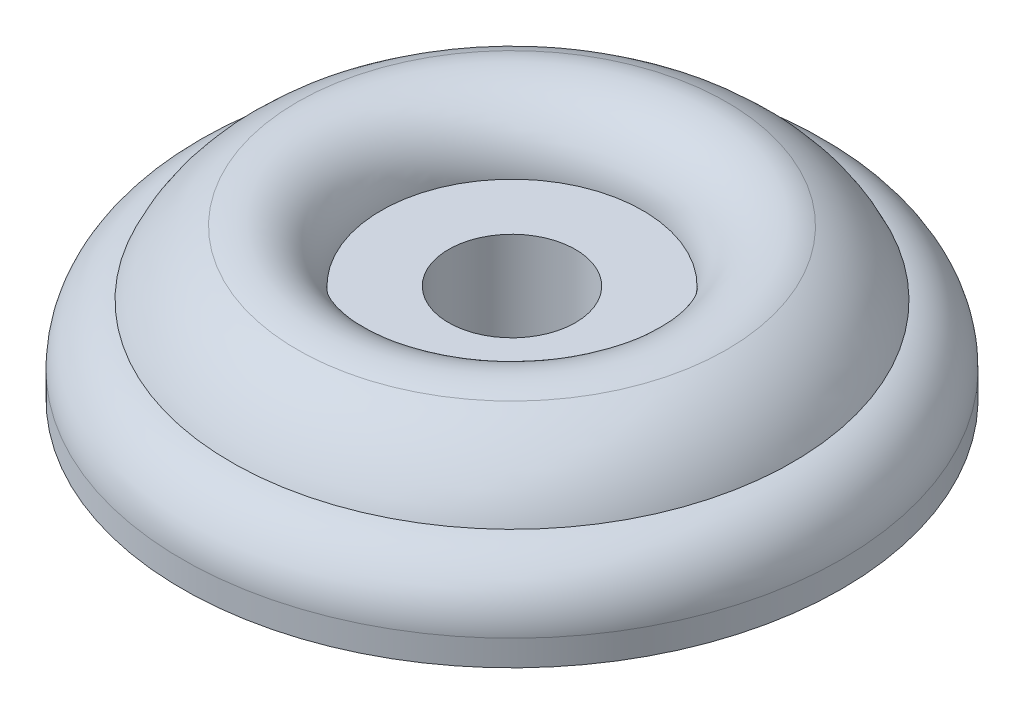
ISO-10303-21;
HEADER;
FILE_DESCRIPTION(('STEP AP214'),'2;1');
FILE_NAME('part.step','',(''),(''),'','','');
FILE_SCHEMA(('AUTOMOTIVE_DESIGN { 1 0 10303 214 1 1 1 1 }'));
ENDSEC;
DATA;
#1=APPLICATION_CONTEXT('core data for automotive mechanical design processes');
#2=APPLICATION_PROTOCOL_DEFINITION('international standard','automotive_design',2000,#1);
#3=PRODUCT_CONTEXT('',#1,'mechanical');
#4=PRODUCT('Part','Part','',(#3));
#5=PRODUCT_RELATED_PRODUCT_CATEGORY('part','',(#4));
#6=PRODUCT_DEFINITION_FORMATION('','',#4);
#7=PRODUCT_DEFINITION_CONTEXT('part definition',#1,'design');
#8=PRODUCT_DEFINITION('design','',#6,#7);
#9=PRODUCT_DEFINITION_SHAPE('','',#8);
#10=(LENGTH_UNIT() NAMED_UNIT(*) SI_UNIT(.MILLI.,.METRE.));
#11=(NAMED_UNIT(*) PLANE_ANGLE_UNIT() SI_UNIT($,.RADIAN.));
#12=(NAMED_UNIT(*) SI_UNIT($,.STERADIAN.) SOLID_ANGLE_UNIT());
#13=UNCERTAINTY_MEASURE_WITH_UNIT(LENGTH_MEASURE(1.E-05),#10,'distance_accuracy_value','');
#14=(GEOMETRIC_REPRESENTATION_CONTEXT(3) GLOBAL_UNCERTAINTY_ASSIGNED_CONTEXT((#13)) GLOBAL_UNIT_ASSIGNED_CONTEXT((#10,
#11,#12)) REPRESENTATION_CONTEXT('',''));
#15=CARTESIAN_POINT('',(0.,0.,0.));
#16=DIRECTION('',(0.,0.,1.));
#17=DIRECTION('',(1.,0.,0.));
#18=AXIS2_PLACEMENT_3D('',#15,#16,#17);
#19=CARTESIAN_POINT('',(64.6348616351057,37.1766513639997,0.));
#20=DIRECTION('',(0.,-1.,0.));
#21=DIRECTION('',(1.,0.,0.));
#22=AXIS2_PLACEMENT_3D('',#19,#20,#21);
#23=PLANE('',#22);
#24=CARTESIAN_POINT('',(53.9120249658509,37.1766513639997,0.));
#25=DIRECTION('',(0.,-1.,0.));
#26=DIRECTION('',(1.,0.,0.));
#27=AXIS2_PLACEMENT_3D('',#24,#25,#26);
#28=CIRCLE('',#27,10.7228366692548);
#29=CARTESIAN_POINT('',(64.6348616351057,37.1766513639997,0.));
#30=VERTEX_POINT('',#29);
#31=EDGE_CURVE('E47',#30,#30,#28,.T.);
#32=ORIENTED_EDGE('',*,*,#31,.F.);
#33=EDGE_LOOP('',(#32));
#34=FACE_BOUND('',#33,.T.);
#35=CARTESIAN_POINT('',(53.9120249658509,37.1766513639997,0.));
#36=DIRECTION('',(0.,-1.,0.));
#37=DIRECTION('',(1.,0.,0.));
#38=AXIS2_PLACEMENT_3D('',#35,#36,#37);
#39=CIRCLE('',#38,5.2);
#40=CARTESIAN_POINT('',(59.1120249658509,37.1766513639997,0.));
#41=VERTEX_POINT('',#40);
#42=EDGE_CURVE('E33',#41,#41,#39,.F.);
#43=ORIENTED_EDGE('',*,*,#42,.F.);
#44=EDGE_LOOP('',(#43));
#45=FACE_BOUND('',#44,.T.);
#46=ADVANCED_FACE('F30',(#34,#45),#23,.F.);
#47=CARTESIAN_POINT('',(53.9120249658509,36.8119102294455,0.));
#48=DIRECTION('',(0.,-1.,0.));
#49=DIRECTION('',(1.,0.,0.));
#50=AXIS2_PLACEMENT_3D('',#47,#48,#49);
#51=TOROIDAL_SURFACE('',#50,15.7095153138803,5.);
#52=CARTESIAN_POINT('',(53.9120249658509,41.4471690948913,0.));
#53=DIRECTION('',(0.,1.,0.));
#54=DIRECTION('',(-1.,0.,0.));
#55=AXIS2_PLACEMENT_3D('',#52,#53,#54);
#56=CIRCLE('',#55,17.5841820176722);
#57=CARTESIAN_POINT('',(36.3278429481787,41.4471690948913,0.));
#58=VERTEX_POINT('',#57);
#59=EDGE_CURVE('E49',#58,#58,#56,.F.);
#60=ORIENTED_EDGE('',*,*,#59,.F.);
#61=EDGE_LOOP('',(#60));
#62=FACE_BOUND('',#61,.T.);
#63=ORIENTED_EDGE('',*,*,#31,.T.);
#64=EDGE_LOOP('',(#63));
#65=FACE_BOUND('',#64,.T.);
#66=ADVANCED_FACE('F73',(#62,#65),#51,.T.);
#67=CARTESIAN_POINT('',(53.9120249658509,32.1766513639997,0.));
#68=DIRECTION('',(0.,1.,0.));
#69=DIRECTION('',(-1.,0.,0.));
#70=AXIS2_PLACEMENT_3D('',#67,#68,#69);
#71=TOROIDAL_SURFACE('',#70,13.8348486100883,10.);
#72=ORIENTED_EDGE('',*,*,#59,.T.);
#73=EDGE_LOOP('',(#72));
#74=FACE_BOUND('',#73,.T.);
#75=CARTESIAN_POINT('',(53.9120249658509,36.1766513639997,0.));
#76=DIRECTION('',(0.,1.,0.));
#77=DIRECTION('',(-1.,0.,0.));
#78=AXIS2_PLACEMENT_3D('',#75,#76,#77);
#79=CIRCLE('',#78,23.);
#80=CARTESIAN_POINT('',(30.9120249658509,36.1766513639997,0.));
#81=VERTEX_POINT('',#80);
#82=EDGE_CURVE('E42',#81,#81,#79,.F.);
#83=ORIENTED_EDGE('',*,*,#82,.F.);
#84=EDGE_LOOP('',(#83));
#85=FACE_BOUND('',#84,.T.);
#86=ADVANCED_FACE('F69',(#74,#85),#71,.T.);
#87=CARTESIAN_POINT('',(53.9120249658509,31.2776718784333,0.));
#88=DIRECTION('',(0.,1.,0.));
#89=DIRECTION('',(-1.,0.,0.));
#90=AXIS2_PLACEMENT_3D('',#87,#88,#89);
#91=TOROIDAL_SURFACE('',#90,22.,5.);
#92=ORIENTED_EDGE('',*,*,#82,.T.);
#93=EDGE_LOOP('',(#92));
#94=FACE_BOUND('',#93,.T.);
#95=CARTESIAN_POINT('',(53.9120249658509,31.2776718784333,0.));
#96=DIRECTION('',(0.,1.,0.));
#97=DIRECTION('',(-1.,0.,0.));
#98=AXIS2_PLACEMENT_3D('',#95,#96,#97);
#99=CIRCLE('',#98,27.);
#100=CARTESIAN_POINT('',(26.9120249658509,31.2776718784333,0.));
#101=VERTEX_POINT('',#100);
#102=EDGE_CURVE('E37',#101,#101,#99,.F.);
#103=ORIENTED_EDGE('',*,*,#102,.F.);
#104=EDGE_LOOP('',(#103));
#105=FACE_BOUND('',#104,.T.);
#106=ADVANCED_FACE('F64',(#94,#105),#91,.T.);
#107=CARTESIAN_POINT('',(53.9120249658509,37.1766513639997,0.));
#108=DIRECTION('',(0.,1.,0.));
#109=DIRECTION('',(-1.,0.,0.));
#110=AXIS2_PLACEMENT_3D('',#107,#108,#109);
#111=CYLINDRICAL_SURFACE('',#110,27.);
#112=ORIENTED_EDGE('',*,*,#102,.T.);
#113=EDGE_LOOP('',(#112));
#114=FACE_BOUND('',#113,.T.);
#115=CARTESIAN_POINT('',(53.9120249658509,29.1766513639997,0.));
#116=DIRECTION('',(0.,1.,0.));
#117=DIRECTION('',(-1.,0.,0.));
#118=AXIS2_PLACEMENT_3D('',#115,#116,#117);
#119=CIRCLE('',#118,27.);
#120=CARTESIAN_POINT('',(26.9120249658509,29.1766513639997,0.));
#121=VERTEX_POINT('',#120);
#122=EDGE_CURVE('E10',#121,#121,#119,.T.);
#123=ORIENTED_EDGE('',*,*,#122,.T.);
#124=EDGE_LOOP('',(#123));
#125=FACE_BOUND('',#124,.T.);
#126=ADVANCED_FACE('F68',(#114,#125),#111,.T.);
#127=CARTESIAN_POINT('',(53.9120249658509,29.1766513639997,0.));
#128=DIRECTION('',(0.,1.,0.));
#129=DIRECTION('',(-1.,0.,0.));
#130=AXIS2_PLACEMENT_3D('',#127,#128,#129);
#131=PLANE('',#130);
#132=CARTESIAN_POINT('',(53.9120249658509,29.1766513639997,0.));
#133=DIRECTION('',(0.,-1.,0.));
#134=DIRECTION('',(1.,0.,0.));
#135=AXIS2_PLACEMENT_3D('',#132,#133,#134);
#136=CIRCLE('',#135,5.2);
#137=CARTESIAN_POINT('',(59.1120249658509,29.1766513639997,0.));
#138=VERTEX_POINT('',#137);
#139=EDGE_CURVE('E50',#138,#138,#136,.T.);
#140=ORIENTED_EDGE('',*,*,#139,.F.);
#141=EDGE_LOOP('',(#140));
#142=FACE_BOUND('',#141,.T.);
#143=ORIENTED_EDGE('',*,*,#122,.F.);
#144=EDGE_LOOP('',(#143));
#145=FACE_BOUND('',#144,.T.);
#146=ADVANCED_FACE('F84',(#142,#145),#131,.F.);
#147=CARTESIAN_POINT('',(53.9120249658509,67.1766513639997,0.));
#148=DIRECTION('',(0.,-1.,0.));
#149=DIRECTION('',(1.,0.,0.));
#150=AXIS2_PLACEMENT_3D('',#147,#148,#149);
#151=CYLINDRICAL_SURFACE('',#150,5.2);
#152=ORIENTED_EDGE('',*,*,#42,.T.);
#153=EDGE_LOOP('',(#152));
#154=FACE_BOUND('',#153,.T.);
#155=ORIENTED_EDGE('',*,*,#139,.T.);
#156=EDGE_LOOP('',(#155));
#157=FACE_BOUND('',#156,.T.);
#158=ADVANCED_FACE('F82',(#154,#157),#151,.F.);
#159=CLOSED_SHELL('',(#46,#66,#86,#106,#126,#146,#158));
#160=MANIFOLD_SOLID_BREP('B2',#159);
#161=ADVANCED_BREP_SHAPE_REPRESENTATION('',(#18,#160),#14);
#162=SHAPE_DEFINITION_REPRESENTATION(#9,#161);
ENDSEC;
END-ISO-10303-21;
